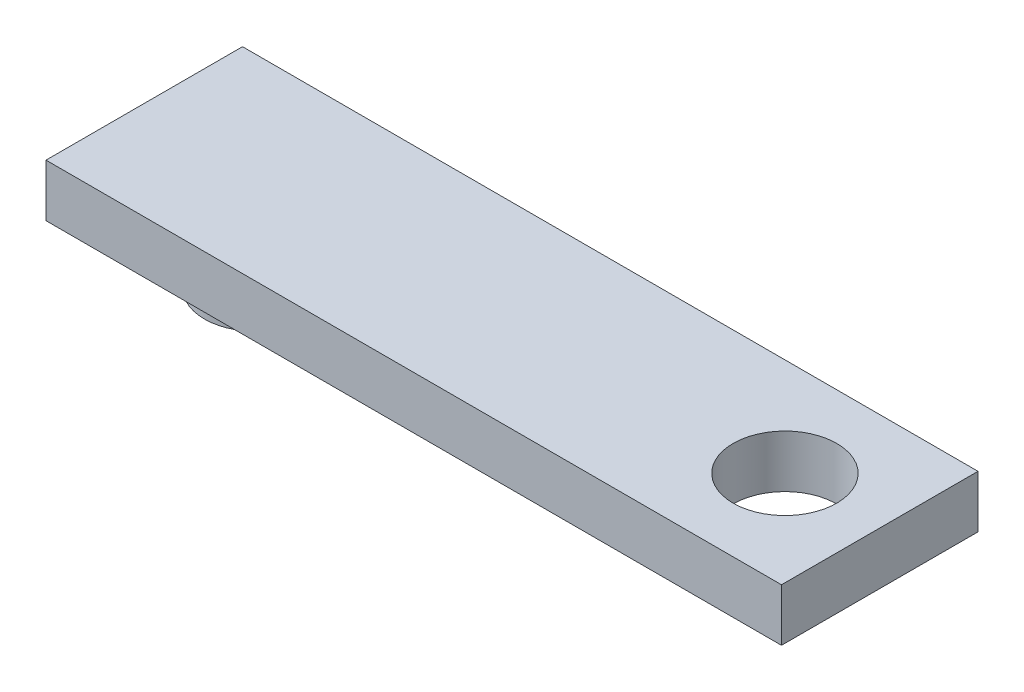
ISO-10303-21;
HEADER;
FILE_DESCRIPTION(('STEP AP214'),'2;1');
FILE_NAME('part.step','',(''),(''),'','','');
FILE_SCHEMA(('AUTOMOTIVE_DESIGN { 1 0 10303 214 1 1 1 1 }'));
ENDSEC;
DATA;
#1=APPLICATION_CONTEXT('core data for automotive mechanical design processes');
#2=APPLICATION_PROTOCOL_DEFINITION('international standard','automotive_design',2000,#1);
#3=PRODUCT_CONTEXT('',#1,'mechanical');
#4=PRODUCT('Part','Part','',(#3));
#5=PRODUCT_RELATED_PRODUCT_CATEGORY('part','',(#4));
#6=PRODUCT_DEFINITION_FORMATION('','',#4);
#7=PRODUCT_DEFINITION_CONTEXT('part definition',#1,'design');
#8=PRODUCT_DEFINITION('design','',#6,#7);
#9=PRODUCT_DEFINITION_SHAPE('','',#8);
#10=(LENGTH_UNIT() NAMED_UNIT(*) SI_UNIT(.MILLI.,.METRE.));
#11=(NAMED_UNIT(*) PLANE_ANGLE_UNIT() SI_UNIT($,.RADIAN.));
#12=(NAMED_UNIT(*) SI_UNIT($,.STERADIAN.) SOLID_ANGLE_UNIT());
#13=UNCERTAINTY_MEASURE_WITH_UNIT(LENGTH_MEASURE(1.E-05),#10,'distance_accuracy_value','');
#14=(GEOMETRIC_REPRESENTATION_CONTEXT(3) GLOBAL_UNCERTAINTY_ASSIGNED_CONTEXT((#13)) GLOBAL_UNIT_ASSIGNED_CONTEXT((#10,
#11,#12)) REPRESENTATION_CONTEXT('',''));
#15=CARTESIAN_POINT('',(0.,0.,0.));
#16=DIRECTION('',(0.,0.,1.));
#17=DIRECTION('',(1.,0.,0.));
#18=AXIS2_PLACEMENT_3D('',#15,#16,#17);
#19=CARTESIAN_POINT('',(0.,10.,0.));
#20=DIRECTION('',(0.,-1.,0.));
#21=DIRECTION('',(0.,0.,-1.));
#22=AXIS2_PLACEMENT_3D('',#19,#20,#21);
#23=CYLINDRICAL_SURFACE('',#22,9.86997587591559);
#24=CARTESIAN_POINT('',(0.,10.,0.));
#25=DIRECTION('',(0.,1.,0.));
#26=DIRECTION('',(0.,0.,1.));
#27=AXIS2_PLACEMENT_3D('',#24,#25,#26);
#28=CIRCLE('',#27,9.86997587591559);
#29=CARTESIAN_POINT('',(0.,10.,9.86997587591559));
#30=VERTEX_POINT('',#29);
#31=EDGE_CURVE('E11',#30,#30,#28,.T.);
#32=ORIENTED_EDGE('',*,*,#31,.F.);
#33=EDGE_LOOP('',(#32));
#34=FACE_BOUND('',#33,.T.);
#35=CARTESIAN_POINT('',(0.,0.,0.));
#36=DIRECTION('',(0.,1.,0.));
#37=DIRECTION('',(0.,0.,1.));
#38=AXIS2_PLACEMENT_3D('',#35,#36,#37);
#39=CIRCLE('',#38,9.86997587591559);
#40=CARTESIAN_POINT('',(0.,0.,9.86997587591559));
#41=VERTEX_POINT('',#40);
#42=EDGE_CURVE('E36',#41,#41,#39,.T.);
#43=ORIENTED_EDGE('',*,*,#42,.T.);
#44=EDGE_LOOP('',(#43));
#45=FACE_BOUND('',#44,.T.);
#46=ADVANCED_FACE('F33',(#34,#45),#23,.T.);
#47=CARTESIAN_POINT('',(0.,0.,0.));
#48=DIRECTION('',(0.,1.,0.));
#49=DIRECTION('',(0.,0.,1.));
#50=AXIS2_PLACEMENT_3D('',#47,#48,#49);
#51=PLANE('',#50);
#52=ORIENTED_EDGE('',*,*,#42,.F.);
#53=EDGE_LOOP('',(#52));
#54=FACE_BOUND('',#53,.T.);
#55=ADVANCED_FACE('F113',(#54),#51,.F.);
#56=CARTESIAN_POINT('',(-21.3395441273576,10.,18.7289269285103));
#57=DIRECTION('',(0.,1.,0.));
#58=DIRECTION('',(0.,0.,1.));
#59=AXIS2_PLACEMENT_3D('',#56,#57,#58);
#60=PLANE('',#59);
#61=CARTESIAN_POINT('',(100.779697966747,10.,0.));
#62=DIRECTION('',(0.,1.,0.));
#63=DIRECTION('',(0.,0.,1.));
#64=AXIS2_PLACEMENT_3D('',#61,#62,#63);
#65=CIRCLE('',#64,9.86997587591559);
#66=CARTESIAN_POINT('',(100.779697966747,10.,9.86997587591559));
#67=VERTEX_POINT('',#66);
#68=EDGE_CURVE('E103',#67,#67,#65,.T.);
#69=ORIENTED_EDGE('',*,*,#68,.T.);
#70=EDGE_LOOP('',(#69));
#71=FACE_BOUND('',#70,.T.);
#72=DIRECTION('',(0.,0.,1.));
#73=VECTOR('',#72,1.);
#74=CARTESIAN_POINT('',(-21.3395441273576,10.,-18.7289269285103));
#75=LINE('',#74,#73);
#76=CARTESIAN_POINT('',(-21.3395441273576,10.,-18.7289269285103));
#77=VERTEX_POINT('',#76);
#78=CARTESIAN_POINT('',(-21.3395441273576,10.,18.7289269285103));
#79=VERTEX_POINT('',#78);
#80=EDGE_CURVE('E100',#77,#79,#75,.T.);
#81=ORIENTED_EDGE('',*,*,#80,.F.);
#82=DIRECTION('',(-1.,0.,0.));
#83=VECTOR('',#82,1.);
#84=CARTESIAN_POINT('',(-21.3395441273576,10.,-18.7289269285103));
#85=LINE('',#84,#83);
#86=CARTESIAN_POINT('',(118.851668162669,10.,-18.7289269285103));
#87=VERTEX_POINT('',#86);
#88=EDGE_CURVE('E72',#87,#77,#85,.T.);
#89=ORIENTED_EDGE('',*,*,#88,.F.);
#90=DIRECTION('',(0.,0.,-1.));
#91=VECTOR('',#90,1.);
#92=CARTESIAN_POINT('',(118.851668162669,10.,-18.7289269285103));
#93=LINE('',#92,#91);
#94=CARTESIAN_POINT('',(118.851668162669,10.,18.7289269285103));
#95=VERTEX_POINT('',#94);
#96=EDGE_CURVE('E66',#95,#87,#93,.T.);
#97=ORIENTED_EDGE('',*,*,#96,.F.);
#98=DIRECTION('',(1.,0.,0.));
#99=VECTOR('',#98,1.);
#100=CARTESIAN_POINT('',(-21.3395441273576,10.,18.7289269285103));
#101=LINE('',#100,#99);
#102=EDGE_CURVE('E90',#79,#95,#101,.T.);
#103=ORIENTED_EDGE('',*,*,#102,.F.);
#104=EDGE_LOOP('',(#81,#89,#97,#103));
#105=FACE_BOUND('',#104,.T.);
#106=ORIENTED_EDGE('',*,*,#31,.T.);
#107=EDGE_LOOP('',(#106));
#108=FACE_BOUND('',#107,.T.);
#109=ADVANCED_FACE('F115',(#71,#105,#108),#60,.F.);
#110=CARTESIAN_POINT('',(-21.3395441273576,20.,-18.7289269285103));
#111=DIRECTION('',(1.,0.,0.));
#112=DIRECTION('',(0.,0.,-1.));
#113=AXIS2_PLACEMENT_3D('',#110,#111,#112);
#114=PLANE('',#113);
#115=ORIENTED_EDGE('',*,*,#80,.T.);
#116=DIRECTION('',(0.,-1.,0.));
#117=VECTOR('',#116,1.);
#118=CARTESIAN_POINT('',(-21.3395441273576,20.,18.7289269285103));
#119=LINE('',#118,#117);
#120=CARTESIAN_POINT('',(-21.3395441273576,20.,18.7289269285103));
#121=VERTEX_POINT('',#120);
#122=EDGE_CURVE('E91',#121,#79,#119,.T.);
#123=ORIENTED_EDGE('',*,*,#122,.F.);
#124=DIRECTION('',(0.,0.,1.));
#125=VECTOR('',#124,1.);
#126=CARTESIAN_POINT('',(-21.3395441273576,20.,-18.7289269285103));
#127=LINE('',#126,#125);
#128=CARTESIAN_POINT('',(-21.3395441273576,20.,-18.7289269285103));
#129=VERTEX_POINT('',#128);
#130=EDGE_CURVE('E85',#129,#121,#127,.T.);
#131=ORIENTED_EDGE('',*,*,#130,.F.);
#132=DIRECTION('',(0.,-1.,0.));
#133=VECTOR('',#132,1.);
#134=CARTESIAN_POINT('',(-21.3395441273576,20.,-18.7289269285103));
#135=LINE('',#134,#133);
#136=EDGE_CURVE('E96',#129,#77,#135,.T.);
#137=ORIENTED_EDGE('',*,*,#136,.T.);
#138=EDGE_LOOP('',(#115,#123,#131,#137));
#139=FACE_BOUND('',#138,.T.);
#140=ADVANCED_FACE('F120',(#139),#114,.F.);
#141=CARTESIAN_POINT('',(-21.3395441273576,20.,18.7289269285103));
#142=DIRECTION('',(0.,0.,-1.));
#143=DIRECTION('',(-1.,0.,0.));
#144=AXIS2_PLACEMENT_3D('',#141,#142,#143);
#145=PLANE('',#144);
#146=ORIENTED_EDGE('',*,*,#102,.T.);
#147=DIRECTION('',(0.,-1.,0.));
#148=VECTOR('',#147,1.);
#149=CARTESIAN_POINT('',(118.851668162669,20.,18.7289269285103));
#150=LINE('',#149,#148);
#151=CARTESIAN_POINT('',(118.851668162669,20.,18.7289269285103));
#152=VERTEX_POINT('',#151);
#153=EDGE_CURVE('E88',#152,#95,#150,.T.);
#154=ORIENTED_EDGE('',*,*,#153,.F.);
#155=DIRECTION('',(1.,0.,0.));
#156=VECTOR('',#155,1.);
#157=CARTESIAN_POINT('',(-21.3395441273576,20.,18.7289269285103));
#158=LINE('',#157,#156);
#159=EDGE_CURVE('E80',#121,#152,#158,.T.);
#160=ORIENTED_EDGE('',*,*,#159,.F.);
#161=ORIENTED_EDGE('',*,*,#122,.T.);
#162=EDGE_LOOP('',(#146,#154,#160,#161));
#163=FACE_BOUND('',#162,.T.);
#164=ADVANCED_FACE('F89',(#163),#145,.F.);
#165=CARTESIAN_POINT('',(118.851668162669,20.,-18.7289269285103));
#166=DIRECTION('',(-1.,0.,0.));
#167=DIRECTION('',(0.,0.,1.));
#168=AXIS2_PLACEMENT_3D('',#165,#166,#167);
#169=PLANE('',#168);
#170=ORIENTED_EDGE('',*,*,#96,.T.);
#171=DIRECTION('',(0.,-1.,0.));
#172=VECTOR('',#171,1.);
#173=CARTESIAN_POINT('',(118.851668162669,20.,-18.7289269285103));
#174=LINE('',#173,#172);
#175=CARTESIAN_POINT('',(118.851668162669,20.,-18.7289269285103));
#176=VERTEX_POINT('',#175);
#177=EDGE_CURVE('E92',#176,#87,#174,.T.);
#178=ORIENTED_EDGE('',*,*,#177,.F.);
#179=DIRECTION('',(0.,0.,-1.));
#180=VECTOR('',#179,1.);
#181=CARTESIAN_POINT('',(118.851668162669,20.,-18.7289269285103));
#182=LINE('',#181,#180);
#183=EDGE_CURVE('E83',#152,#176,#182,.T.);
#184=ORIENTED_EDGE('',*,*,#183,.F.);
#185=ORIENTED_EDGE('',*,*,#153,.T.);
#186=EDGE_LOOP('',(#170,#178,#184,#185));
#187=FACE_BOUND('',#186,.T.);
#188=ADVANCED_FACE('F94',(#187),#169,.F.);
#189=CARTESIAN_POINT('',(-21.3395441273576,20.,-18.7289269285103));
#190=DIRECTION('',(0.,0.,1.));
#191=DIRECTION('',(1.,0.,0.));
#192=AXIS2_PLACEMENT_3D('',#189,#190,#191);
#193=PLANE('',#192);
#194=ORIENTED_EDGE('',*,*,#88,.T.);
#195=ORIENTED_EDGE('',*,*,#136,.F.);
#196=DIRECTION('',(-1.,0.,0.));
#197=VECTOR('',#196,1.);
#198=CARTESIAN_POINT('',(-21.3395441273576,20.,-18.7289269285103));
#199=LINE('',#198,#197);
#200=EDGE_CURVE('E49',#176,#129,#199,.T.);
#201=ORIENTED_EDGE('',*,*,#200,.F.);
#202=ORIENTED_EDGE('',*,*,#177,.T.);
#203=EDGE_LOOP('',(#194,#195,#201,#202));
#204=FACE_BOUND('',#203,.T.);
#205=ADVANCED_FACE('F132',(#204),#193,.F.);
#206=CARTESIAN_POINT('',(-21.3395441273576,20.,18.7289269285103));
#207=DIRECTION('',(0.,1.,0.));
#208=DIRECTION('',(0.,0.,1.));
#209=AXIS2_PLACEMENT_3D('',#206,#207,#208);
#210=PLANE('',#209);
#211=CARTESIAN_POINT('',(100.779697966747,20.,0.));
#212=DIRECTION('',(0.,1.,0.));
#213=DIRECTION('',(0.,0.,1.));
#214=AXIS2_PLACEMENT_3D('',#211,#212,#213);
#215=CIRCLE('',#214,9.86997587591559);
#216=CARTESIAN_POINT('',(100.779697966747,20.,9.86997587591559));
#217=VERTEX_POINT('',#216);
#218=EDGE_CURVE('E148',#217,#217,#215,.T.);
#219=ORIENTED_EDGE('',*,*,#218,.F.);
#220=EDGE_LOOP('',(#219));
#221=FACE_BOUND('',#220,.T.);
#222=ORIENTED_EDGE('',*,*,#130,.T.);
#223=ORIENTED_EDGE('',*,*,#159,.T.);
#224=ORIENTED_EDGE('',*,*,#183,.T.);
#225=ORIENTED_EDGE('',*,*,#200,.T.);
#226=EDGE_LOOP('',(#222,#223,#224,#225));
#227=FACE_BOUND('',#226,.T.);
#228=ADVANCED_FACE('F81',(#221,#227),#210,.T.);
#229=CARTESIAN_POINT('',(100.779697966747,10.,0.));
#230=DIRECTION('',(0.,1.,0.));
#231=DIRECTION('',(0.,0.,1.));
#232=AXIS2_PLACEMENT_3D('',#229,#230,#231);
#233=CYLINDRICAL_SURFACE('',#232,9.86997587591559);
#234=ORIENTED_EDGE('',*,*,#68,.F.);
#235=EDGE_LOOP('',(#234));
#236=FACE_BOUND('',#235,.T.);
#237=ORIENTED_EDGE('',*,*,#218,.T.);
#238=EDGE_LOOP('',(#237));
#239=FACE_BOUND('',#238,.T.);
#240=ADVANCED_FACE('F137',(#236,#239),#233,.F.);
#241=CLOSED_SHELL('',(#46,#55,#109,#140,#164,#188,#205,#228,#240));
#242=MANIFOLD_SOLID_BREP('B2',#241);
#243=ADVANCED_BREP_SHAPE_REPRESENTATION('',(#18,#242),#14);
#244=SHAPE_DEFINITION_REPRESENTATION(#9,#243);
ENDSEC;
END-ISO-10303-21;
